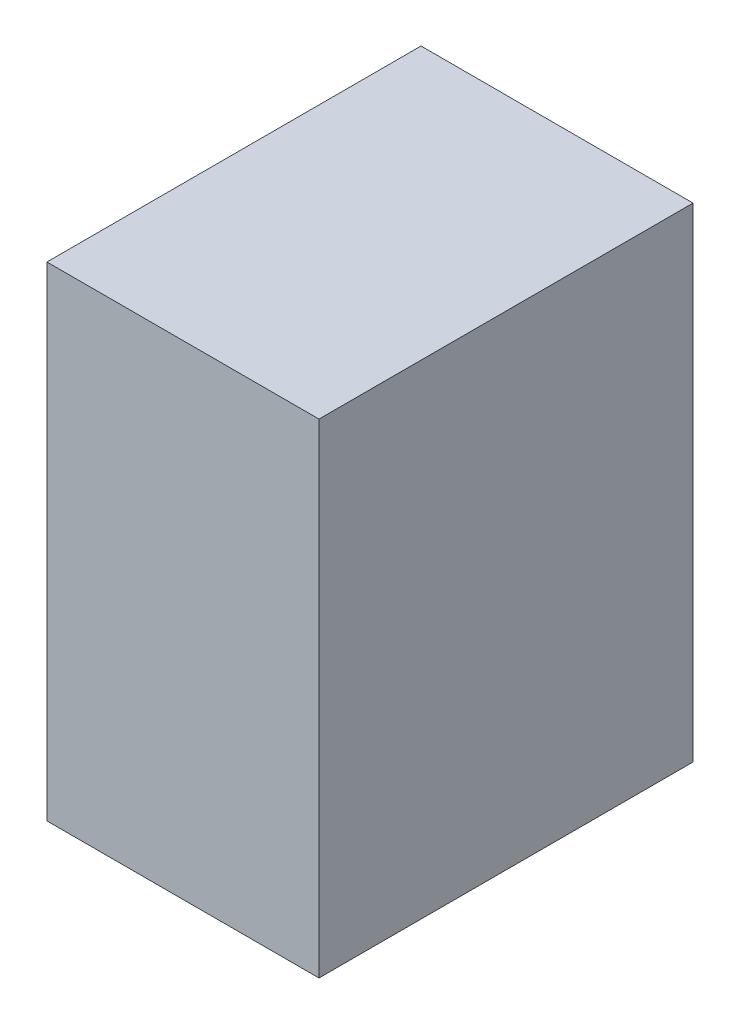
ISO-10303-21;
HEADER;
FILE_DESCRIPTION(('STEP AP214'),'2;1');
FILE_NAME('part.step','',(''),(''),'','','');
FILE_SCHEMA(('AUTOMOTIVE_DESIGN { 1 0 10303 214 1 1 1 1 }'));
ENDSEC;
DATA;
#1=APPLICATION_CONTEXT('core data for automotive mechanical design processes');
#2=APPLICATION_PROTOCOL_DEFINITION('international standard','automotive_design',2000,#1);
#3=PRODUCT_CONTEXT('',#1,'mechanical');
#4=PRODUCT('Part','Part','',(#3));
#5=PRODUCT_RELATED_PRODUCT_CATEGORY('part','',(#4));
#6=PRODUCT_DEFINITION_FORMATION('','',#4);
#7=PRODUCT_DEFINITION_CONTEXT('part definition',#1,'design');
#8=PRODUCT_DEFINITION('design','',#6,#7);
#9=PRODUCT_DEFINITION_SHAPE('','',#8);
#10=(LENGTH_UNIT() NAMED_UNIT(*) SI_UNIT(.MILLI.,.METRE.));
#11=(NAMED_UNIT(*) PLANE_ANGLE_UNIT() SI_UNIT($,.RADIAN.));
#12=(NAMED_UNIT(*) SI_UNIT($,.STERADIAN.) SOLID_ANGLE_UNIT());
#13=UNCERTAINTY_MEASURE_WITH_UNIT(LENGTH_MEASURE(1.E-05),#10,'distance_accuracy_value','');
#14=(GEOMETRIC_REPRESENTATION_CONTEXT(3) GLOBAL_UNCERTAINTY_ASSIGNED_CONTEXT((#13)) GLOBAL_UNIT_ASSIGNED_CONTEXT((#10,
#11,#12)) REPRESENTATION_CONTEXT('',''));
#15=CARTESIAN_POINT('',(0.,0.,0.));
#16=DIRECTION('',(0.,0.,1.));
#17=DIRECTION('',(1.,0.,0.));
#18=AXIS2_PLACEMENT_3D('',#15,#16,#17);
#19=CARTESIAN_POINT('',(120.,213.5,330.));
#20=DIRECTION('',(-1.,0.,0.));
#21=DIRECTION('',(0.,-1.,0.));
#22=AXIS2_PLACEMENT_3D('',#19,#20,#21);
#23=PLANE('',#22);
#24=DIRECTION('',(0.,1.,0.));
#25=VECTOR('',#24,1.);
#26=CARTESIAN_POINT('',(120.,213.5,0.));
#27=LINE('',#26,#25);
#28=CARTESIAN_POINT('',(120.,-213.5,0.));
#29=VERTEX_POINT('',#28);
#30=CARTESIAN_POINT('',(120.,213.5,0.));
#31=VERTEX_POINT('',#30);
#32=EDGE_CURVE('E94',#29,#31,#27,.T.);
#33=ORIENTED_EDGE('',*,*,#32,.T.);
#34=DIRECTION('',(0.,0.,-1.));
#35=VECTOR('',#34,1.);
#36=CARTESIAN_POINT('',(120.,213.5,330.));
#37=LINE('',#36,#35);
#38=CARTESIAN_POINT('',(120.,213.5,330.));
#39=VERTEX_POINT('',#38);
#40=EDGE_CURVE('E11',#39,#31,#37,.T.);
#41=ORIENTED_EDGE('',*,*,#40,.F.);
#42=DIRECTION('',(0.,1.,0.));
#43=VECTOR('',#42,1.);
#44=CARTESIAN_POINT('',(120.,213.5,330.));
#45=LINE('',#44,#43);
#46=CARTESIAN_POINT('',(120.,-213.5,330.));
#47=VERTEX_POINT('',#46);
#48=EDGE_CURVE('E82',#47,#39,#45,.T.);
#49=ORIENTED_EDGE('',*,*,#48,.F.);
#50=DIRECTION('',(0.,0.,-1.));
#51=VECTOR('',#50,1.);
#52=CARTESIAN_POINT('',(120.,-213.5,330.));
#53=LINE('',#52,#51);
#54=EDGE_CURVE('E90',#47,#29,#53,.T.);
#55=ORIENTED_EDGE('',*,*,#54,.T.);
#56=EDGE_LOOP('',(#33,#41,#49,#55));
#57=FACE_BOUND('',#56,.T.);
#58=ADVANCED_FACE('F31',(#57),#23,.F.);
#59=CARTESIAN_POINT('',(-120.,213.5,330.));
#60=DIRECTION('',(0.,-1.,0.));
#61=DIRECTION('',(0.,0.,-1.));
#62=AXIS2_PLACEMENT_3D('',#59,#60,#61);
#63=PLANE('',#62);
#64=DIRECTION('',(-1.,0.,0.));
#65=VECTOR('',#64,1.);
#66=CARTESIAN_POINT('',(-120.,213.5,0.));
#67=LINE('',#66,#65);
#68=CARTESIAN_POINT('',(-120.,213.5,0.));
#69=VERTEX_POINT('',#68);
#70=EDGE_CURVE('E86',#31,#69,#67,.T.);
#71=ORIENTED_EDGE('',*,*,#70,.T.);
#72=DIRECTION('',(0.,0.,-1.));
#73=VECTOR('',#72,1.);
#74=CARTESIAN_POINT('',(-120.,213.5,330.));
#75=LINE('',#74,#73);
#76=CARTESIAN_POINT('',(-120.,213.5,330.));
#77=VERTEX_POINT('',#76);
#78=EDGE_CURVE('E39',#77,#69,#75,.T.);
#79=ORIENTED_EDGE('',*,*,#78,.F.);
#80=DIRECTION('',(-1.,0.,0.));
#81=VECTOR('',#80,1.);
#82=CARTESIAN_POINT('',(-120.,213.5,330.));
#83=LINE('',#82,#81);
#84=EDGE_CURVE('E77',#39,#77,#83,.T.);
#85=ORIENTED_EDGE('',*,*,#84,.F.);
#86=ORIENTED_EDGE('',*,*,#40,.T.);
#87=EDGE_LOOP('',(#71,#79,#85,#86));
#88=FACE_BOUND('',#87,.T.);
#89=ADVANCED_FACE('F85',(#88),#63,.F.);
#90=CARTESIAN_POINT('',(-120.,213.5,330.));
#91=DIRECTION('',(1.,0.,0.));
#92=DIRECTION('',(0.,1.,0.));
#93=AXIS2_PLACEMENT_3D('',#90,#91,#92);
#94=PLANE('',#93);
#95=DIRECTION('',(0.,-1.,0.));
#96=VECTOR('',#95,1.);
#97=CARTESIAN_POINT('',(-120.,213.5,0.));
#98=LINE('',#97,#96);
#99=CARTESIAN_POINT('',(-120.,-213.5,0.));
#100=VERTEX_POINT('',#99);
#101=EDGE_CURVE('E64',#69,#100,#98,.T.);
#102=ORIENTED_EDGE('',*,*,#101,.T.);
#103=DIRECTION('',(0.,0.,-1.));
#104=VECTOR('',#103,1.);
#105=CARTESIAN_POINT('',(-120.,-213.5,330.));
#106=LINE('',#105,#104);
#107=CARTESIAN_POINT('',(-120.,-213.5,330.));
#108=VERTEX_POINT('',#107);
#109=EDGE_CURVE('E87',#108,#100,#106,.T.);
#110=ORIENTED_EDGE('',*,*,#109,.F.);
#111=DIRECTION('',(0.,-1.,0.));
#112=VECTOR('',#111,1.);
#113=CARTESIAN_POINT('',(-120.,213.5,330.));
#114=LINE('',#113,#112);
#115=EDGE_CURVE('E80',#77,#108,#114,.T.);
#116=ORIENTED_EDGE('',*,*,#115,.F.);
#117=ORIENTED_EDGE('',*,*,#78,.T.);
#118=EDGE_LOOP('',(#102,#110,#116,#117));
#119=FACE_BOUND('',#118,.T.);
#120=ADVANCED_FACE('F88',(#119),#94,.F.);
#121=CARTESIAN_POINT('',(-120.,-213.5,330.));
#122=DIRECTION('',(0.,1.,0.));
#123=DIRECTION('',(0.,0.,1.));
#124=AXIS2_PLACEMENT_3D('',#121,#122,#123);
#125=PLANE('',#124);
#126=DIRECTION('',(1.,0.,0.));
#127=VECTOR('',#126,1.);
#128=CARTESIAN_POINT('',(-120.,-213.5,0.));
#129=LINE('',#128,#127);
#130=EDGE_CURVE('E70',#100,#29,#129,.T.);
#131=ORIENTED_EDGE('',*,*,#130,.T.);
#132=ORIENTED_EDGE('',*,*,#54,.F.);
#133=DIRECTION('',(1.,0.,0.));
#134=VECTOR('',#133,1.);
#135=CARTESIAN_POINT('',(-120.,-213.5,330.));
#136=LINE('',#135,#134);
#137=EDGE_CURVE('E47',#108,#47,#136,.T.);
#138=ORIENTED_EDGE('',*,*,#137,.F.);
#139=ORIENTED_EDGE('',*,*,#109,.T.);
#140=EDGE_LOOP('',(#131,#132,#138,#139));
#141=FACE_BOUND('',#140,.T.);
#142=ADVANCED_FACE('F101',(#141),#125,.F.);
#143=CARTESIAN_POINT('',(120.,-213.5,330.));
#144=DIRECTION('',(0.,0.,1.));
#145=DIRECTION('',(1.,0.,0.));
#146=AXIS2_PLACEMENT_3D('',#143,#144,#145);
#147=PLANE('',#146);
#148=ORIENTED_EDGE('',*,*,#48,.T.);
#149=ORIENTED_EDGE('',*,*,#84,.T.);
#150=ORIENTED_EDGE('',*,*,#115,.T.);
#151=ORIENTED_EDGE('',*,*,#137,.T.);
#152=EDGE_LOOP('',(#148,#149,#150,#151));
#153=FACE_BOUND('',#152,.T.);
#154=ADVANCED_FACE('F78',(#153),#147,.T.);
#155=CARTESIAN_POINT('',(120.,-213.5,0.));
#156=DIRECTION('',(0.,0.,1.));
#157=DIRECTION('',(1.,0.,0.));
#158=AXIS2_PLACEMENT_3D('',#155,#156,#157);
#159=PLANE('',#158);
#160=ORIENTED_EDGE('',*,*,#32,.F.);
#161=ORIENTED_EDGE('',*,*,#130,.F.);
#162=ORIENTED_EDGE('',*,*,#101,.F.);
#163=ORIENTED_EDGE('',*,*,#70,.F.);
#164=EDGE_LOOP('',(#160,#161,#162,#163));
#165=FACE_BOUND('',#164,.T.);
#166=ADVANCED_FACE('F104',(#165),#159,.F.);
#167=CLOSED_SHELL('',(#58,#89,#120,#142,#154,#166));
#168=MANIFOLD_SOLID_BREP('B2',#167);
#169=ADVANCED_BREP_SHAPE_REPRESENTATION('',(#18,#168),#14);
#170=SHAPE_DEFINITION_REPRESENTATION(#9,#169);
ENDSEC;
END-ISO-10303-21;
